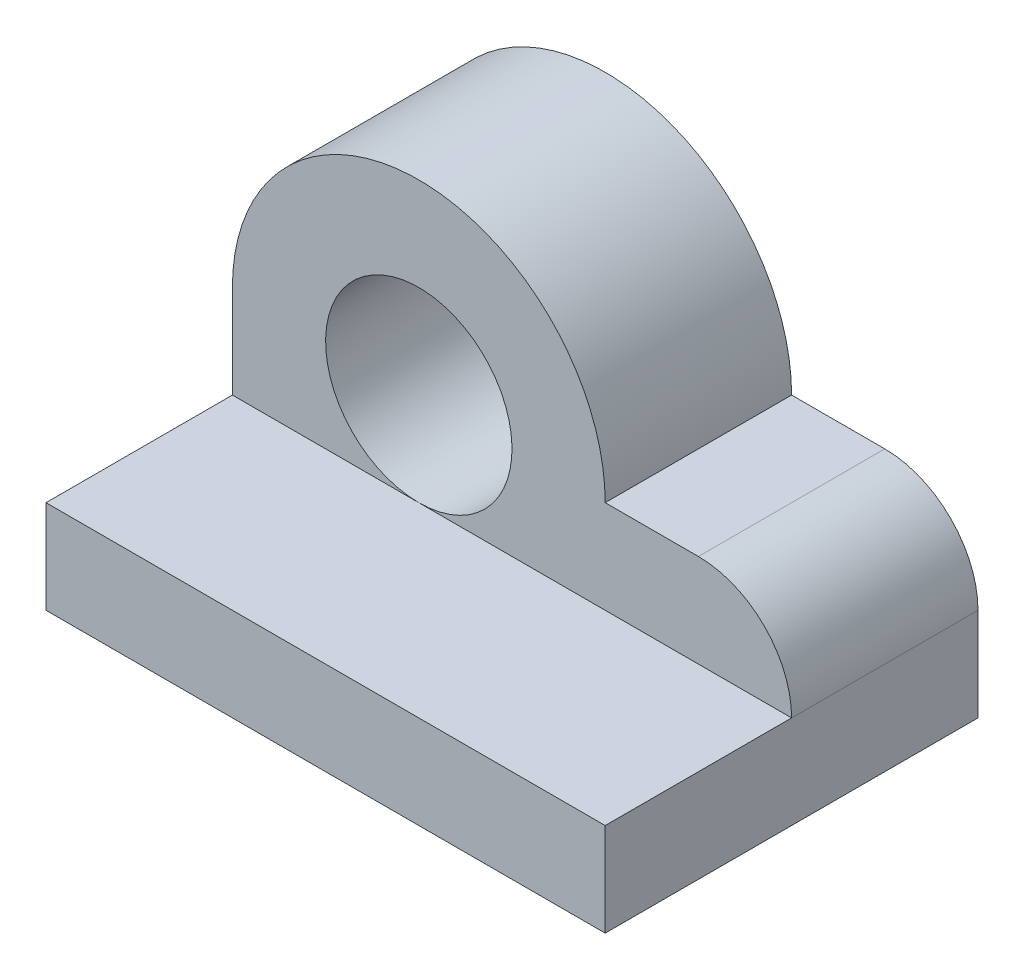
from build123d import *

# Parameters (mm, degrees)
SKETCH1_R      = 10
EXTRUDE1_DEPTH = 10
EXTRUDE2_DEPTH = 30


with BuildPart() as part:
    # Sketch1 → Extrude1 (new, symmetric)
    with BuildSketch(Plane.XY):
        with BuildLine():
            Line((20, 0), (30, 0))
            ThreePointArc((30, 0), (37.071067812, -2.928932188), (40, -10))
            Line((40, -10), (40, -20))
            Line((40, -20), (-20, -20))
            Line((-20, -20), (-20, 0))
            ThreePointArc((-20, 0), (0, 20), (20, 0))
        make_face()
        Circle(SKETCH1_R, mode=Mode.SUBTRACT)
    extrude(amount=EXTRUDE1_DEPTH, both=True)

    # Sketch → Extrude2 (add)
    with BuildSketch(Plane.XY):
        Polygon((40, -20), (40, -10), (-2.7e-08, -10), (-20, -10), (-20, -20), align=None)
    extrude(amount=EXTRUDE2_DEPTH)


solid = part.part
